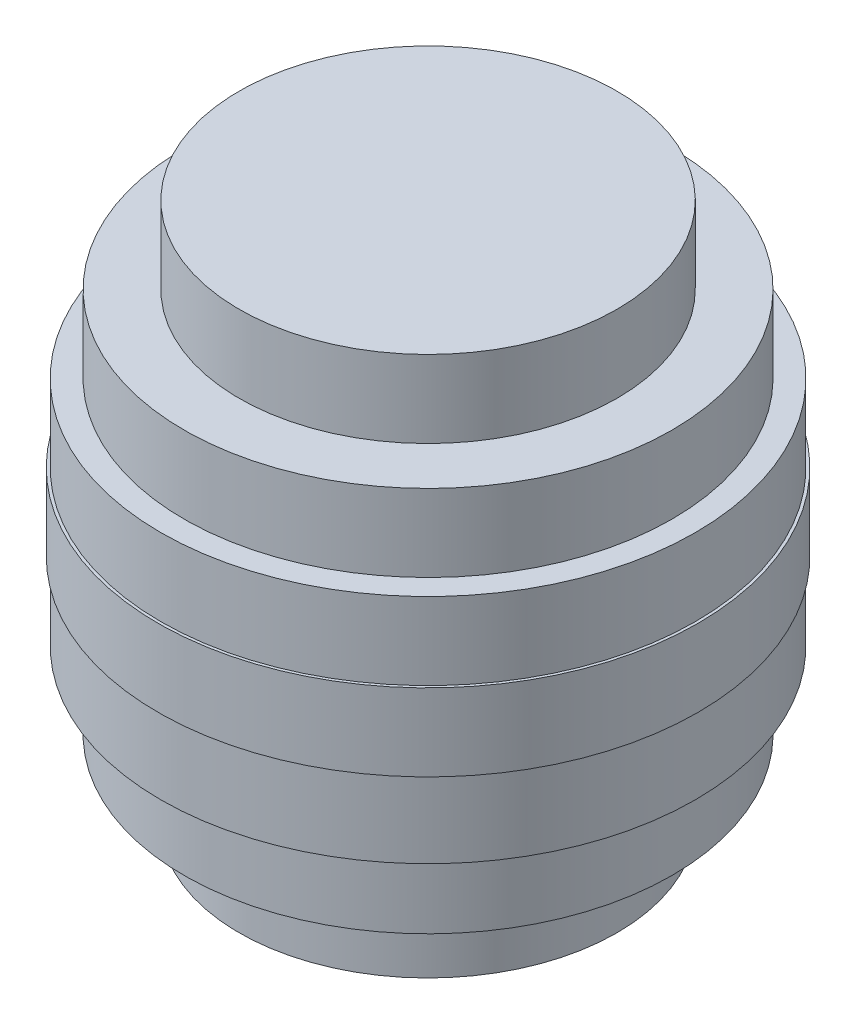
from build123d import *


with BuildPart() as part:
    # Sketch2 → Revolve1 (revolve)
    with BuildSketch(Plane.XY):
        Polygon((17.5, 2.5), (17.5, -2.5), (17.320508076, -2.5), (17.320508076, -7.5), (15.811388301, -7.5), (15.811388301, -12.5), (12.247448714, -12.5), (12.247448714, -17.5), (0, -17.5), (0, 17.5), (12.247448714, 17.5), (12.247448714, 12.5), (15.811388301, 12.5), (15.811388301, 7.5), (17.320508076, 7.5), (17.320508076, 2.5), align=None)
    revolve(axis=Axis((0, -17.5, 0), (0, 1, 0)))


solid = part.part
